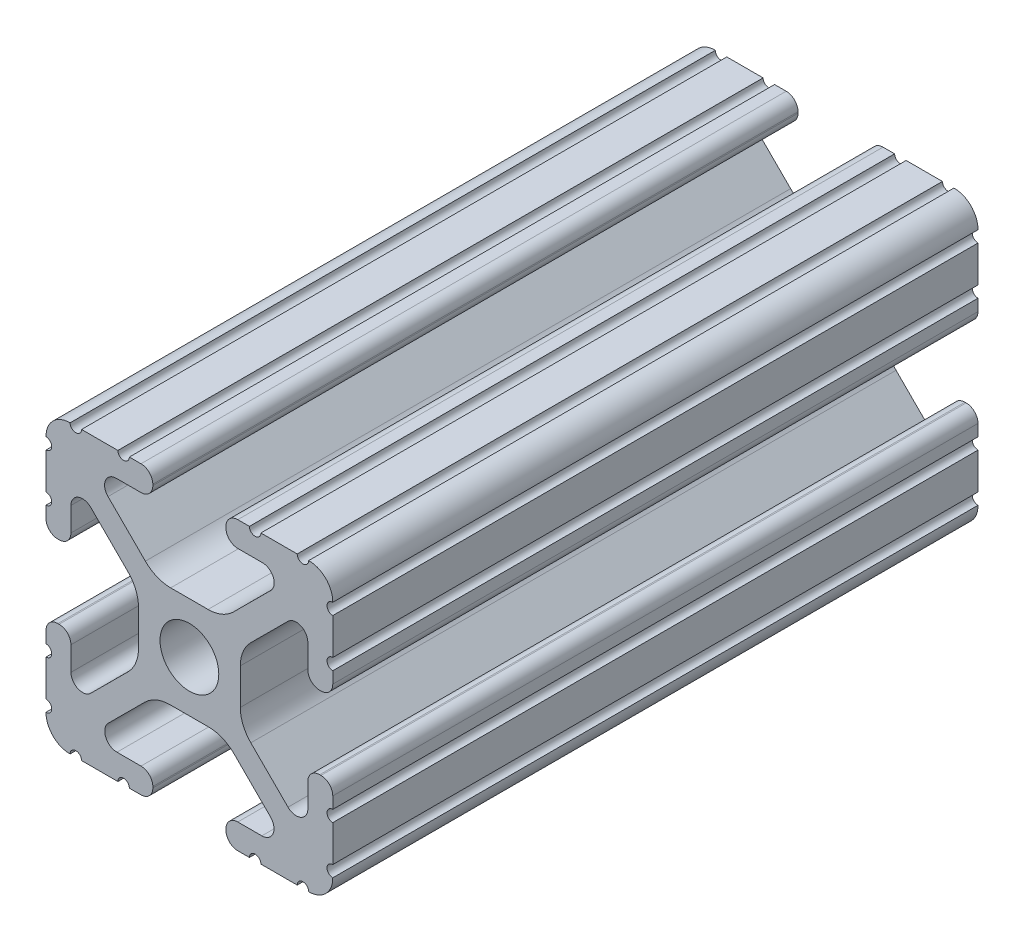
from build123d import *

# Parameters (mm, degrees)
SKETCH1_R           = 2.6035
BOSS_EXTRUDE1_DEPTH = 28.575


with BuildPart() as part:
    # Sketch1 → Boss-Extrude1 (new, symmetric)
    with BuildSketch(Plane.XY):
        with BuildLine():
            Line((-7.179650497, -8.645192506), (-3.952270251, -5.423690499))
            ThreePointArc((-3.952270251, -5.423690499), (-2.922936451, -4.736929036), (-1.709253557, -4.4958))
            Line((-1.709253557, -4.4958), (1.709253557, -4.4958))
            ThreePointArc((1.709253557, -4.4958), (2.922936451, -4.736929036), (3.952270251, -5.423690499))
            Line((3.952270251, -5.423690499), (7.179650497, -8.645192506))
            ThreePointArc((7.179650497, -8.645192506), (7.41473083, -9.822813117), (6.416408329, -10.4902))
            Line((6.416408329, -10.4902), (4.287512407, -10.4902))
            ThreePointArc((4.287512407, -10.4902), (3.54574862, -10.79744862), (3.2385, -11.539212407))
            Line((3.2385, -11.539212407), (3.2385, -11.650987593))
            ThreePointArc((3.2385, -11.650987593), (3.54574862, -12.39275138), (4.287512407, -12.7))
            Line((4.287512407, -12.7), (5.317126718, -12.7))
            ThreePointArc((5.317126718, -12.7), (5.825126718, -12.192), (6.333126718, -12.7))
            Line((6.333126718, -12.7), (9.550443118, -12.7))
            ThreePointArc((9.550443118, -12.7), (10.058366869, -12.192000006), (10.566443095, -12.699847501))
            ThreePointArc((10.566443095, -12.699847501), (12.082537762, -12.08250727), (12.699846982, -10.566399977))
            ThreePointArc((12.699846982, -10.566399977), (12.192000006, -10.058323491), (12.7, -9.5504))
            Line((12.7, -9.5504), (12.7, -6.3330836))
            ThreePointArc((12.7, -6.3330836), (12.192, -5.8250836), (12.7, -5.3170836))
            Line((12.7, -5.3170836), (12.7, -4.287469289))
            ThreePointArc((12.7, -4.287469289), (12.39275138, -3.545705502), (11.650987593, -3.238456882))
            Line((11.650987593, -3.238456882), (11.539212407, -3.238456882))
            ThreePointArc((11.539212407, -3.238456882), (10.79744862, -3.545705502), (10.4902, -4.287469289))
            Line((10.4902, -4.287469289), (10.4902, -6.402089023))
            ThreePointArc((10.4902, -6.402089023), (9.856505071, -7.351067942), (8.737131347, -7.129408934))
            Line((8.737131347, -7.129408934), (5.441005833, -3.840816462))
            ThreePointArc((5.441005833, -3.840816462), (4.750877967, -2.809883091), (4.5085, -1.593185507))
            Line((4.5085, -1.593185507), (4.5085, 1.593185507))
            ThreePointArc((4.5085, 1.593185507), (4.750877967, 2.809883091), (5.441005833, 3.840816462))
            Line((5.441005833, 3.840816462), (8.737131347, 7.129408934))
            ThreePointArc((8.737131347, 7.129408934), (9.856505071, 7.351067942), (10.4902, 6.402089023))
            Line((10.4902, 6.402089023), (10.4902, 4.287469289))
            ThreePointArc((10.4902, 4.287469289), (10.79744862, 3.545705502), (11.539212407, 3.238456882))
            Line((11.539212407, 3.238456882), (11.650987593, 3.238456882))
            ThreePointArc((11.650987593, 3.238456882), (12.39275138, 3.545705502), (12.7, 4.287469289))
            Line((12.7, 4.287469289), (12.7, 5.3170836))
            ThreePointArc((12.7, 5.3170836), (12.192, 5.8250836), (12.7, 6.3330836))
            Line((12.7, 6.3330836), (12.7, 9.5504))
            ThreePointArc((12.7, 9.5504), (12.192000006, 10.058323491), (12.699846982, 10.566399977))
            ThreePointArc((12.699846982, 10.566399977), (12.082537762, 12.08250727), (10.566443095, 12.699847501))
            ThreePointArc((10.566443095, 12.699847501), (10.058366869, 12.192000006), (9.550443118, 12.7))
            Line((9.550443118, 12.7), (6.333126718, 12.7))
            ThreePointArc((6.333126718, 12.7), (5.825126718, 12.192), (5.317126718, 12.7))
            Line((5.317126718, 12.7), (4.287512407, 12.7))
            ThreePointArc((4.287512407, 12.7), (3.54574862, 12.39275138), (3.2385, 11.650987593))
            Line((3.2385, 11.650987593), (3.2385, 11.539212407))
            ThreePointArc((3.2385, 11.539212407), (3.54574862, 10.79744862), (4.287512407, 10.4902))
            Line((4.287512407, 10.4902), (6.476788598, 10.4902))
            ThreePointArc((6.476788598, 10.4902), (7.432222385, 9.85140422), (7.207036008, 8.724370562))
            Line((7.207036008, 8.724370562), (3.898272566, 5.423169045))
            ThreePointArc((3.898272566, 5.423169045), (2.869120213, 4.736787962), (1.655778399, 4.4958))
            Line((1.655778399, 4.4958), (-1.655778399, 4.4958))
            ThreePointArc((-1.655778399, 4.4958), (-2.869120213, 4.736787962), (-3.898272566, 5.423169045))
            Line((-3.898272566, 5.423169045), (-7.207036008, 8.724370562))
            ThreePointArc((-7.207036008, 8.724370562), (-7.432222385, 9.85140422), (-6.476788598, 10.4902))
            Line((-6.476788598, 10.4902), (-4.287512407, 10.4902))
            ThreePointArc((-4.287512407, 10.4902), (-3.54574862, 10.79744862), (-3.2385, 11.539212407))
            Line((-3.2385, 11.539212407), (-3.2385, 11.650987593))
            ThreePointArc((-3.2385, 11.650987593), (-3.54574862, 12.39275138), (-4.287512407, 12.7))
            Line((-4.287512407, 12.7), (-5.317126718, 12.7))
            ThreePointArc((-5.317126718, 12.7), (-5.825126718, 12.192), (-6.333126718, 12.7))
            Line((-6.333126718, 12.7), (-9.550443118, 12.7))
            ThreePointArc((-9.550443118, 12.7), (-10.058366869, 12.192000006), (-10.566443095, 12.699847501))
            ThreePointArc((-10.566443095, 12.699847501), (-12.082537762, 12.08250727), (-12.699846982, 10.566399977))
            ThreePointArc((-12.699846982, 10.566399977), (-12.192000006, 10.058323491), (-12.7, 9.5504))
            Line((-12.7, 9.5504), (-12.7, 6.3330836))
            ThreePointArc((-12.7, 6.3330836), (-12.192, 5.8250836), (-12.7, 5.3170836))
            Line((-12.7, 5.3170836), (-12.7, 4.287469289))
            ThreePointArc((-12.7, 4.287469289), (-12.39275138, 3.545705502), (-11.650987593, 3.238456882))
            Line((-11.650987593, 3.238456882), (-11.539212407, 3.238456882))
            ThreePointArc((-11.539212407, 3.238456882), (-10.79744862, 3.545705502), (-10.4902, 4.287469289))
            Line((-10.4902, 4.287469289), (-10.4902, 6.402089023))
            ThreePointArc((-10.4902, 6.402089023), (-9.856505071, 7.351067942), (-8.737131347, 7.129408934))
            Line((-8.737131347, 7.129408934), (-5.441005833, 3.840816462))
            ThreePointArc((-5.441005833, 3.840816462), (-4.750877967, 2.809883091), (-4.5085, 1.593185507))
            Line((-4.5085, 1.593185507), (-4.5085, -1.593185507))
            ThreePointArc((-4.5085, -1.593185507), (-4.750877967, -2.809883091), (-5.441005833, -3.840816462))
            Line((-5.441005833, -3.840816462), (-8.737131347, -7.129408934))
            ThreePointArc((-8.737131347, -7.129408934), (-9.856505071, -7.351067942), (-10.4902, -6.402089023))
            Line((-10.4902, -6.402089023), (-10.4902, -4.287469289))
            ThreePointArc((-10.4902, -4.287469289), (-10.79744862, -3.545705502), (-11.539212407, -3.238456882))
            Line((-11.539212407, -3.238456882), (-11.650987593, -3.238456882))
            ThreePointArc((-11.650987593, -3.238456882), (-12.39275138, -3.545705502), (-12.7, -4.287469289))
            Line((-12.7, -4.287469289), (-12.7, -5.3170836))
            ThreePointArc((-12.7, -5.3170836), (-12.192, -5.8250836), (-12.7, -6.3330836))
            Line((-12.7, -6.3330836), (-12.7, -9.5504))
            ThreePointArc((-12.7, -9.5504), (-12.192000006, -10.058323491), (-12.699846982, -10.566399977))
            ThreePointArc((-12.699846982, -10.566399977), (-12.082537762, -12.08250727), (-10.566443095, -12.699847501))
            ThreePointArc((-10.566443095, -12.699847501), (-10.058366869, -12.192000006), (-9.550443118, -12.7))
            Line((-9.550443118, -12.7), (-6.333126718, -12.7))
            ThreePointArc((-6.333126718, -12.7), (-5.825126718, -12.192), (-5.317126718, -12.7))
            Line((-5.317126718, -12.7), (-4.287512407, -12.7))
            ThreePointArc((-4.287512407, -12.7), (-3.54574862, -12.39275138), (-3.2385, -11.650987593))
            Line((-3.2385, -11.650987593), (-3.2385, -11.539212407))
            ThreePointArc((-3.2385, -11.539212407), (-3.54574862, -10.79744862), (-4.287512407, -10.4902))
            Line((-4.287512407, -10.4902), (-6.416408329, -10.4902))
            ThreePointArc((-6.416408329, -10.4902), (-7.41473083, -9.822813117), (-7.179650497, -8.645192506))
        make_face()
        Circle(SKETCH1_R, mode=Mode.SUBTRACT)
    extrude(amount=BOSS_EXTRUDE1_DEPTH, both=True)


solid = part.part
